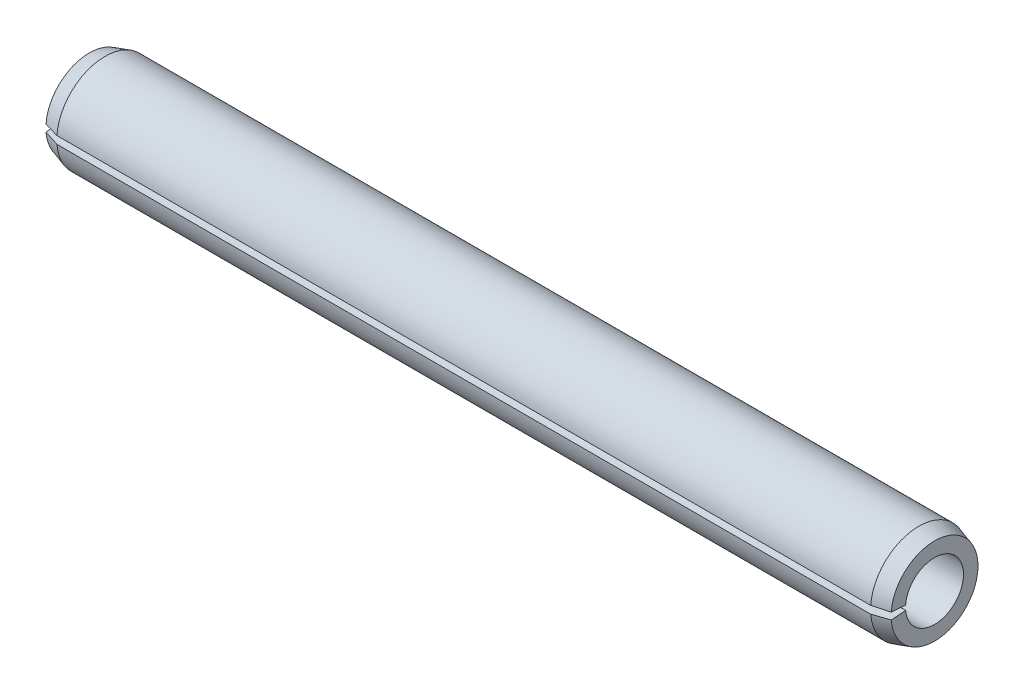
from build123d import *

# Parameters (mm, degrees)
GAP_DEPTH = 36.114099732


with BuildPart() as part:
    # Sketch1 → Base-Revolve (revolve)
    with BuildSketch(Plane.XY, mode=Mode.PRIVATE) as base_revolve_sk:
        Polygon((0, 1.2), (35, 1.2), (35, 1.8), (34.35, 2), (0.65, 2), (0, 1.8), align=None)
    revolve(base_revolve_sk.sketch.rotate(Axis((-9.525, 0, 0), (1, 0, 0)), 90), axis=Axis((-9.525, 0, 0), (1, 0, 0)))

    # Sketch2 → Gap (cut, through all)
    with BuildSketch(Plane(origin=(0, 0, 0), x_dir=(0, -1, 0), z_dir=(-1, 0, 0))):
        with BuildLine():
            Line((0, 0), (0.160056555, 2.033711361))
            ThreePointArc((0.160056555, 2.033711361), (0, 2.04), (-0.160056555, 2.033711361))
            Line((-0.160056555, 2.033711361), (0, 0))
        make_face()
    extrude(amount=-GAP_DEPTH, mode=Mode.SUBTRACT)


solid = part.part
